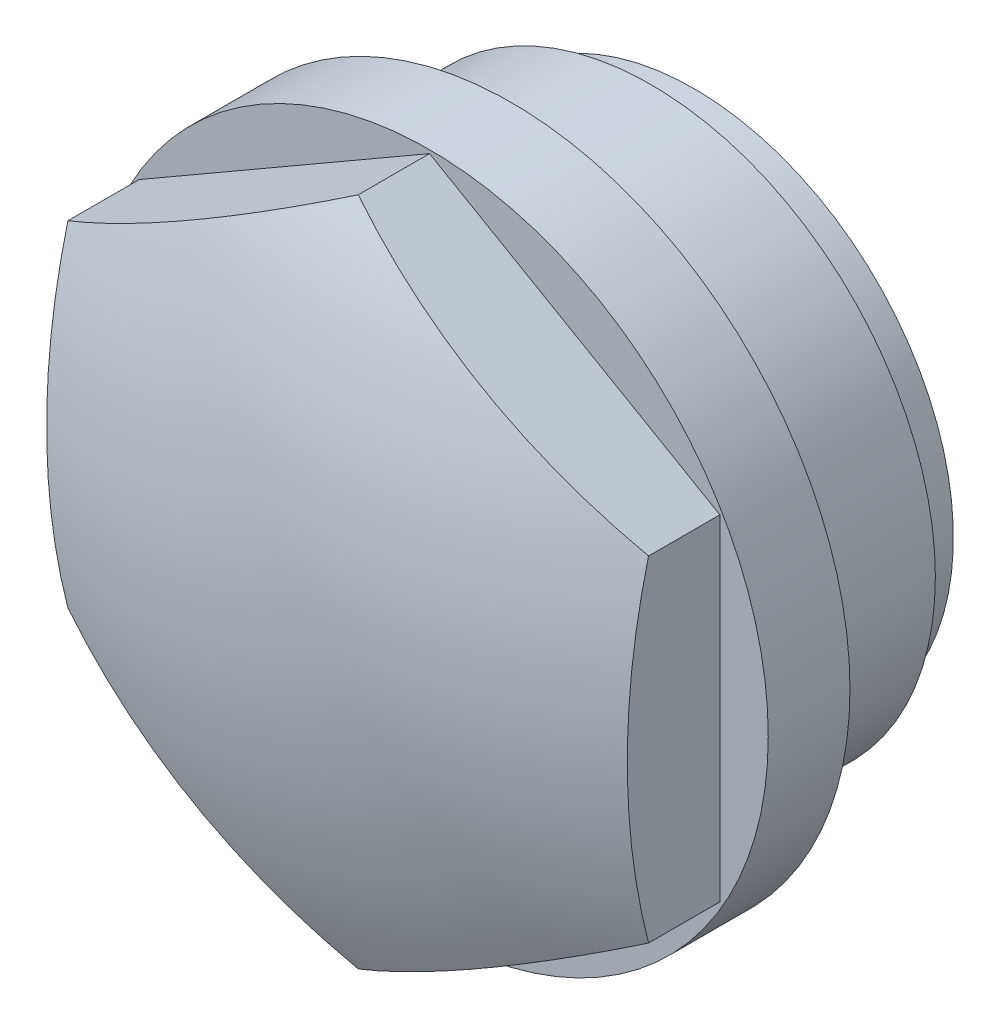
ISO-10303-21;
HEADER;
FILE_DESCRIPTION(('STEP AP214'),'2;1');
FILE_NAME('part.step','',(''),(''),'','','');
FILE_SCHEMA(('AUTOMOTIVE_DESIGN { 1 0 10303 214 1 1 1 1 }'));
ENDSEC;
DATA;
#1=APPLICATION_CONTEXT('core data for automotive mechanical design processes');
#2=APPLICATION_PROTOCOL_DEFINITION('international standard','automotive_design',2000,#1);
#3=PRODUCT_CONTEXT('',#1,'mechanical');
#4=PRODUCT('Part','Part','',(#3));
#5=PRODUCT_RELATED_PRODUCT_CATEGORY('part','',(#4));
#6=PRODUCT_DEFINITION_FORMATION('','',#4);
#7=PRODUCT_DEFINITION_CONTEXT('part definition',#1,'design');
#8=PRODUCT_DEFINITION('design','',#6,#7);
#9=PRODUCT_DEFINITION_SHAPE('','',#8);
#10=(LENGTH_UNIT() NAMED_UNIT(*) SI_UNIT(.MILLI.,.METRE.));
#11=(NAMED_UNIT(*) PLANE_ANGLE_UNIT() SI_UNIT($,.RADIAN.));
#12=(NAMED_UNIT(*) SI_UNIT($,.STERADIAN.) SOLID_ANGLE_UNIT());
#13=UNCERTAINTY_MEASURE_WITH_UNIT(LENGTH_MEASURE(1.E-05),#10,'distance_accuracy_value','');
#14=(GEOMETRIC_REPRESENTATION_CONTEXT(3) GLOBAL_UNCERTAINTY_ASSIGNED_CONTEXT((#13)) GLOBAL_UNIT_ASSIGNED_CONTEXT((#10,
#11,#12)) REPRESENTATION_CONTEXT('',''));
#15=CARTESIAN_POINT('',(0.,0.,0.));
#16=DIRECTION('',(0.,0.,1.));
#17=DIRECTION('',(1.,0.,0.));
#18=AXIS2_PLACEMENT_3D('',#15,#16,#17);
#19=CARTESIAN_POINT('',(0.,0.,-15.016713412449));
#20=DIRECTION('',(0.,0.,-1.));
#21=DIRECTION('',(-1.,0.,0.));
#22=AXIS2_PLACEMENT_3D('',#19,#20,#21);
#23=CYLINDRICAL_SURFACE('',#22,15.7499999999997);
#24=CARTESIAN_POINT('',(0.,0.,0.));
#25=DIRECTION('',(0.,0.,-1.));
#26=DIRECTION('',(-1.,0.,0.));
#27=AXIS2_PLACEMENT_3D('',#24,#25,#26);
#28=CIRCLE('',#27,15.75);
#29=CARTESIAN_POINT('',(-15.75,0.,0.));
#30=VERTEX_POINT('',#29);
#31=EDGE_CURVE('E103',#30,#30,#28,.T.);
#32=ORIENTED_EDGE('',*,*,#31,.F.);
#33=EDGE_LOOP('',(#32));
#34=FACE_BOUND('',#33,.T.);
#35=CARTESIAN_POINT('',(0.,0.,3.8));
#36=DIRECTION('',(0.,0.,-1.));
#37=DIRECTION('',(-1.,0.,0.));
#38=AXIS2_PLACEMENT_3D('',#35,#36,#37);
#39=CIRCLE('',#38,15.7499999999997);
#40=CARTESIAN_POINT('',(-15.7499999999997,0.,3.8));
#41=VERTEX_POINT('',#40);
#42=EDGE_CURVE('E118',#41,#41,#39,.T.);
#43=ORIENTED_EDGE('',*,*,#42,.T.);
#44=EDGE_LOOP('',(#43));
#45=FACE_BOUND('',#44,.T.);
#46=ADVANCED_FACE('F14',(#34,#45),#23,.T.);
#47=CARTESIAN_POINT('',(0.,15.58845726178,3.8));
#48=DIRECTION('',(0.,0.,-1.));
#49=DIRECTION('',(-1.,0.,0.));
#50=AXIS2_PLACEMENT_3D('',#47,#48,#49);
#51=PLANE('',#50);
#52=ORIENTED_EDGE('',*,*,#42,.F.);
#53=EDGE_LOOP('',(#52));
#54=FACE_BOUND('',#53,.T.);
#55=DIRECTION('',(0.,1.,0.));
#56=VECTOR('',#55,1.);
#57=CARTESIAN_POINT('',(-13.4999999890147,-7.79422862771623,3.8));
#58=LINE('',#57,#56);
#59=CARTESIAN_POINT('',(-13.4999999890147,-7.79422862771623,3.8));
#60=VERTEX_POINT('',#59);
#61=CARTESIAN_POINT('',(-13.4999999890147,7.79422862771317,3.8));
#62=VERTEX_POINT('',#61);
#63=EDGE_CURVE('E93',#60,#62,#58,.T.);
#64=ORIENTED_EDGE('',*,*,#63,.T.);
#65=DIRECTION('',(0.866025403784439,0.5,0.));
#66=VECTOR('',#65,1.);
#67=CARTESIAN_POINT('',(-13.4999999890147,7.79422862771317,3.8));
#68=LINE('',#67,#66);
#69=CARTESIAN_POINT('',(-6.93889390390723E-12,15.588457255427,3.8));
#70=VERTEX_POINT('',#69);
#71=EDGE_CURVE('E83',#62,#70,#68,.T.);
#72=ORIENTED_EDGE('',*,*,#71,.T.);
#73=DIRECTION('',(0.866025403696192,-0.500000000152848,0.));
#74=VECTOR('',#73,1.);
#75=CARTESIAN_POINT('',(-6.93889390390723E-12,15.588457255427,3.8));
#76=LINE('',#75,#74);
#77=CARTESIAN_POINT('',(13.4999999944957,7.79422862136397,3.8));
#78=VERTEX_POINT('',#77);
#79=EDGE_CURVE('E68',#70,#78,#76,.T.);
#80=ORIENTED_EDGE('',*,*,#79,.T.);
#81=DIRECTION('',(0.,-1.,0.));
#82=VECTOR('',#81,1.);
#83=CARTESIAN_POINT('',(13.4999999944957,7.79422862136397,3.8));
#84=LINE('',#83,#82);
#85=CARTESIAN_POINT('',(13.4999999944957,-7.79422863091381,3.8));
#86=VERTEX_POINT('',#85);
#87=EDGE_CURVE('E80',#78,#86,#84,.T.);
#88=ORIENTED_EDGE('',*,*,#87,.T.);
#89=DIRECTION('',(-0.866025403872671,-0.499999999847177,0.));
#90=VECTOR('',#89,1.);
#91=CARTESIAN_POINT('',(13.4999999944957,-7.79422862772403,3.8));
#92=LINE('',#91,#90);
#93=CARTESIAN_POINT('',(-3.60822483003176E-12,-15.5884572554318,3.8));
#94=VERTEX_POINT('',#93);
#95=EDGE_CURVE('E28',#86,#94,#92,.T.);
#96=ORIENTED_EDGE('',*,*,#95,.T.);
#97=DIRECTION('',(-0.866025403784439,0.5,0.));
#98=VECTOR('',#97,1.);
#99=CARTESIAN_POINT('',(-3.60822483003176E-12,-15.5884572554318,3.8));
#100=LINE('',#99,#98);
#101=EDGE_CURVE('E87',#94,#60,#100,.T.);
#102=ORIENTED_EDGE('',*,*,#101,.T.);
#103=EDGE_LOOP('',(#64,#72,#80,#88,#96,#102));
#104=FACE_BOUND('',#103,.T.);
#105=ADVANCED_FACE('F79',(#54,#104),#51,.F.);
#106=CARTESIAN_POINT('',(0.,0.,-8.5));
#107=DIRECTION('',(0.,0.,-1.));
#108=DIRECTION('',(-1.,0.,0.));
#109=AXIS2_PLACEMENT_3D('',#106,#107,#108);
#110=PLANE('',#109);
#111=CARTESIAN_POINT('',(0.,0.,-8.5));
#112=DIRECTION('',(0.,0.,-1.));
#113=DIRECTION('',(-1.,0.,0.));
#114=AXIS2_PLACEMENT_3D('',#111,#112,#113);
#115=CIRCLE('',#114,12.0585);
#116=CARTESIAN_POINT('',(-12.0585,0.,-8.5));
#117=VERTEX_POINT('',#116);
#118=EDGE_CURVE('E115',#117,#117,#115,.T.);
#119=ORIENTED_EDGE('',*,*,#118,.T.);
#120=EDGE_LOOP('',(#119));
#121=FACE_BOUND('',#120,.T.);
#122=ADVANCED_FACE('F160',(#121),#110,.T.);
#123=CARTESIAN_POINT('',(0.,0.,-15.016713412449));
#124=DIRECTION('',(0.,0.,-1.));
#125=DIRECTION('',(-1.,0.,0.));
#126=AXIS2_PLACEMENT_3D('',#123,#124,#125);
#127=CYLINDRICAL_SURFACE('',#126,12.0585);
#128=ORIENTED_EDGE('',*,*,#118,.F.);
#129=EDGE_LOOP('',(#128));
#130=FACE_BOUND('',#129,.T.);
#131=CARTESIAN_POINT('',(0.,0.,-6.5));
#132=DIRECTION('',(0.,0.,-1.));
#133=DIRECTION('',(-1.,0.,0.));
#134=AXIS2_PLACEMENT_3D('',#131,#132,#133);
#135=CIRCLE('',#134,12.0585);
#136=CARTESIAN_POINT('',(-12.0585,0.,-6.5));
#137=VERTEX_POINT('',#136);
#138=EDGE_CURVE('E112',#137,#137,#135,.T.);
#139=ORIENTED_EDGE('',*,*,#138,.T.);
#140=EDGE_LOOP('',(#139));
#141=FACE_BOUND('',#140,.T.);
#142=ADVANCED_FACE('F184',(#130,#141),#127,.T.);
#143=CARTESIAN_POINT('',(0.,12.0585,-6.5));
#144=DIRECTION('',(0.,0.,-1.));
#145=DIRECTION('',(-1.,0.,0.));
#146=AXIS2_PLACEMENT_3D('',#143,#144,#145);
#147=PLANE('',#146);
#148=CARTESIAN_POINT('',(0.,0.,-6.5));
#149=DIRECTION('',(0.,0.,-1.));
#150=DIRECTION('',(-1.,0.,0.));
#151=AXIS2_PLACEMENT_3D('',#148,#149,#150);
#152=CIRCLE('',#151,13.2205);
#153=CARTESIAN_POINT('',(-13.2205,0.,-6.5));
#154=VERTEX_POINT('',#153);
#155=EDGE_CURVE('E109',#154,#154,#152,.T.);
#156=ORIENTED_EDGE('',*,*,#155,.T.);
#157=EDGE_LOOP('',(#156));
#158=FACE_BOUND('',#157,.T.);
#159=ORIENTED_EDGE('',*,*,#138,.F.);
#160=EDGE_LOOP('',(#159));
#161=FACE_BOUND('',#160,.T.);
#162=ADVANCED_FACE('F177',(#158,#161),#147,.T.);
#163=CARTESIAN_POINT('',(0.,0.,-15.016713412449));
#164=DIRECTION('',(0.,0.,-1.));
#165=DIRECTION('',(-1.,0.,0.));
#166=AXIS2_PLACEMENT_3D('',#163,#164,#165);
#167=CYLINDRICAL_SURFACE('',#166,13.2205);
#168=ORIENTED_EDGE('',*,*,#155,.F.);
#169=EDGE_LOOP('',(#168));
#170=FACE_BOUND('',#169,.T.);
#171=CARTESIAN_POINT('',(0.,0.,0.));
#172=DIRECTION('',(0.,0.,-1.));
#173=DIRECTION('',(-1.,0.,0.));
#174=AXIS2_PLACEMENT_3D('',#171,#172,#173);
#175=CIRCLE('',#174,13.2205);
#176=CARTESIAN_POINT('',(-13.2205,0.,0.));
#177=VERTEX_POINT('',#176);
#178=EDGE_CURVE('E106',#177,#177,#175,.T.);
#179=ORIENTED_EDGE('',*,*,#178,.T.);
#180=EDGE_LOOP('',(#179));
#181=FACE_BOUND('',#180,.T.);
#182=ADVANCED_FACE('F168',(#170,#181),#167,.T.);
#183=CARTESIAN_POINT('',(0.,15.75,0.));
#184=DIRECTION('',(0.,0.,1.));
#185=DIRECTION('',(1.,0.,0.));
#186=AXIS2_PLACEMENT_3D('',#183,#184,#185);
#187=PLANE('',#186);
#188=ORIENTED_EDGE('',*,*,#178,.F.);
#189=EDGE_LOOP('',(#188));
#190=FACE_BOUND('',#189,.T.);
#191=ORIENTED_EDGE('',*,*,#31,.T.);
#192=EDGE_LOOP('',(#191));
#193=FACE_BOUND('',#192,.T.);
#194=ADVANCED_FACE('F166',(#190,#193),#187,.F.);
#195=CARTESIAN_POINT('',(-13.4999999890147,7.79422862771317,10.9000000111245));
#196=DIRECTION('',(-0.5,0.866025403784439,0.));
#197=DIRECTION('',(0.866025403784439,0.5,0.));
#198=AXIS2_PLACEMENT_3D('',#195,#196,#197);
#199=PLANE('',#198);
#200=DIRECTION('',(0.,0.,-1.));
#201=VECTOR('',#200,1.);
#202=CARTESIAN_POINT('',(-6.93889390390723E-12,15.588457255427,10.9000000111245));
#203=LINE('',#202,#201);
#204=CARTESIAN_POINT('',(-1.10110487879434E-08,15.58845726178,7.1158898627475));
#205=VERTEX_POINT('',#204);
#206=EDGE_CURVE('E36',#205,#70,#203,.T.);
#207=ORIENTED_EDGE('',*,*,#206,.T.);
#208=ORIENTED_EDGE('',*,*,#71,.F.);
#209=DIRECTION('',(0.,0.,-1.));
#210=VECTOR('',#209,1.);
#211=CARTESIAN_POINT('',(-13.4999999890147,7.79422862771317,10.9000000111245));
#212=LINE('',#211,#210);
#213=CARTESIAN_POINT('',(-13.4999999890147,7.79422862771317,7.11588986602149));
#214=VERTEX_POINT('',#213);
#215=EDGE_CURVE('E101',#214,#62,#212,.T.);
#216=ORIENTED_EDGE('',*,*,#215,.F.);
#217=CARTESIAN_POINT('',(-6.74999999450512,11.6913429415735,-23.0999999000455));
#218=DIRECTION('',(-0.5,0.866025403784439,0.));
#219=DIRECTION('',(0.866025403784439,0.5,0.));
#220=AXIS2_PLACEMENT_3D('',#217,#218,#219);
#221=CIRCLE('',#220,31.2049674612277);
#222=EDGE_CURVE('E9',#205,#214,#221,.F.);
#223=ORIENTED_EDGE('',*,*,#222,.F.);
#224=EDGE_LOOP('',(#207,#208,#216,#223));
#225=FACE_BOUND('',#224,.T.);
#226=ADVANCED_FACE('F138',(#225),#199,.T.);
#227=CARTESIAN_POINT('',(-13.4999999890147,-7.79422862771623,10.9000000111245));
#228=DIRECTION('',(-1.,0.,0.));
#229=DIRECTION('',(0.,0.,1.));
#230=AXIS2_PLACEMENT_3D('',#227,#228,#229);
#231=PLANE('',#230);
#232=ORIENTED_EDGE('',*,*,#215,.T.);
#233=ORIENTED_EDGE('',*,*,#63,.F.);
#234=DIRECTION('',(0.,0.,-1.));
#235=VECTOR('',#234,1.);
#236=CARTESIAN_POINT('',(-13.4999999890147,-7.79422862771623,10.9000000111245));
#237=LINE('',#236,#235);
#238=CARTESIAN_POINT('',(-13.4999999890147,-7.79422862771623,7.11588986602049));
#239=VERTEX_POINT('',#238);
#240=EDGE_CURVE('E99',#239,#60,#237,.T.);
#241=ORIENTED_EDGE('',*,*,#240,.F.);
#242=CARTESIAN_POINT('',(-13.4999999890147,0.,-23.0999999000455));
#243=DIRECTION('',(-1.,0.,0.));
#244=DIRECTION('',(0.,0.,1.));
#245=AXIS2_PLACEMENT_3D('',#242,#243,#244);
#246=CIRCLE('',#245,31.2049674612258);
#247=EDGE_CURVE('E21',#214,#239,#246,.F.);
#248=ORIENTED_EDGE('',*,*,#247,.F.);
#249=EDGE_LOOP('',(#232,#233,#241,#248));
#250=FACE_BOUND('',#249,.T.);
#251=ADVANCED_FACE('F135',(#250),#231,.T.);
#252=CARTESIAN_POINT('',(-3.60822483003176E-12,-15.5884572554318,10.9000000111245));
#253=DIRECTION('',(-0.5,-0.866025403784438,0.));
#254=DIRECTION('',(-0.866025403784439,0.5,0.));
#255=AXIS2_PLACEMENT_3D('',#252,#253,#254);
#256=PLANE('',#255);
#257=ORIENTED_EDGE('',*,*,#240,.T.);
#258=ORIENTED_EDGE('',*,*,#101,.F.);
#259=DIRECTION('',(0.,0.,-1.));
#260=VECTOR('',#259,1.);
#261=CARTESIAN_POINT('',(-3.60822483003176E-12,-15.5884572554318,10.9000000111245));
#262=LINE('',#261,#260);
#263=CARTESIAN_POINT('',(-3.60215329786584E-12,-15.5884572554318,7.11588986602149));
#264=VERTEX_POINT('',#263);
#265=EDGE_CURVE('E97',#264,#94,#262,.T.);
#266=ORIENTED_EDGE('',*,*,#265,.F.);
#267=CARTESIAN_POINT('',(-6.74999999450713,-11.691342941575,-23.0999999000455));
#268=DIRECTION('',(-0.5,-0.866025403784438,0.));
#269=DIRECTION('',(-0.866025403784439,0.5,0.));
#270=AXIS2_PLACEMENT_3D('',#267,#268,#269);
#271=CIRCLE('',#270,31.204967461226);
#272=EDGE_CURVE('E127',#239,#264,#271,.F.);
#273=ORIENTED_EDGE('',*,*,#272,.F.);
#274=EDGE_LOOP('',(#257,#258,#266,#273));
#275=FACE_BOUND('',#274,.T.);
#276=ADVANCED_FACE('F143',(#275),#256,.T.);
#277=CARTESIAN_POINT('',(13.4999999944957,-7.79422862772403,10.9000000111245));
#278=DIRECTION('',(0.499999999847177,-0.866025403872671,0.));
#279=DIRECTION('',(-0.866025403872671,-0.499999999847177,0.));
#280=AXIS2_PLACEMENT_3D('',#277,#278,#279);
#281=PLANE('',#280);
#282=ORIENTED_EDGE('',*,*,#265,.T.);
#283=ORIENTED_EDGE('',*,*,#95,.F.);
#284=DIRECTION('',(0.,0.,-1.));
#285=VECTOR('',#284,1.);
#286=CARTESIAN_POINT('',(13.4999999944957,-7.79422862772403,10.9000000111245));
#287=LINE('',#286,#285);
#288=CARTESIAN_POINT('',(13.4999999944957,-7.79422862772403,7.11588986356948));
#289=VERTEX_POINT('',#288);
#290=EDGE_CURVE('E74',#289,#86,#287,.T.);
#291=ORIENTED_EDGE('',*,*,#290,.F.);
#292=CARTESIAN_POINT('',(6.74999999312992,-11.6913429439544,-23.0999999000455));
#293=DIRECTION('',(0.499999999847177,-0.866025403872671,0.));
#294=DIRECTION('',(-0.866025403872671,-0.499999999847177,0.));
#295=AXIS2_PLACEMENT_3D('',#292,#293,#294);
#296=CIRCLE('',#295,31.2049674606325);
#297=EDGE_CURVE('E124',#264,#289,#296,.F.);
#298=ORIENTED_EDGE('',*,*,#297,.F.);
#299=EDGE_LOOP('',(#282,#283,#291,#298));
#300=FACE_BOUND('',#299,.T.);
#301=ADVANCED_FACE('F139',(#300),#281,.T.);
#302=CARTESIAN_POINT('',(13.4999999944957,7.79422862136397,10.9000000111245));
#303=DIRECTION('',(1.,0.,0.));
#304=DIRECTION('',(0.,0.,-1.));
#305=AXIS2_PLACEMENT_3D('',#302,#303,#304);
#306=PLANE('',#305);
#307=ORIENTED_EDGE('',*,*,#290,.T.);
#308=ORIENTED_EDGE('',*,*,#87,.F.);
#309=DIRECTION('',(0.,0.,-1.));
#310=VECTOR('',#309,1.);
#311=CARTESIAN_POINT('',(13.4999999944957,7.79422862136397,10.9000000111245));
#312=LINE('',#311,#310);
#313=CARTESIAN_POINT('',(13.4999999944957,7.79422862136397,7.1158898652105));
#314=VERTEX_POINT('',#313);
#315=EDGE_CURVE('E65',#314,#78,#312,.T.);
#316=ORIENTED_EDGE('',*,*,#315,.F.);
#317=CARTESIAN_POINT('',(13.4999999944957,0.,-23.0999999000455));
#318=DIRECTION('',(1.,0.,0.));
#319=DIRECTION('',(0.,0.,-1.));
#320=AXIS2_PLACEMENT_3D('',#317,#318,#319);
#321=CIRCLE('',#320,31.2049674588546);
#322=EDGE_CURVE('E122',#289,#314,#321,.F.);
#323=ORIENTED_EDGE('',*,*,#322,.F.);
#324=EDGE_LOOP('',(#307,#308,#316,#323));
#325=FACE_BOUND('',#324,.T.);
#326=ADVANCED_FACE('F85',(#325),#306,.T.);
#327=CARTESIAN_POINT('',(-6.93889390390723E-12,15.588457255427,10.9000000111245));
#328=DIRECTION('',(0.500000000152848,0.866025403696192,0.));
#329=DIRECTION('',(0.866025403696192,-0.500000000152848,0.));
#330=AXIS2_PLACEMENT_3D('',#327,#328,#329);
#331=PLANE('',#330);
#332=ORIENTED_EDGE('',*,*,#315,.T.);
#333=ORIENTED_EDGE('',*,*,#79,.F.);
#334=ORIENTED_EDGE('',*,*,#206,.F.);
#335=CARTESIAN_POINT('',(6.74999999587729,11.6913429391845,-23.0999999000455));
#336=DIRECTION('',(0.500000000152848,0.866025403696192,0.));
#337=DIRECTION('',(0.866025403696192,-0.500000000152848,0.));
#338=AXIS2_PLACEMENT_3D('',#335,#336,#337);
#339=CIRCLE('',#338,31.2049674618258);
#340=EDGE_CURVE('E70',#314,#205,#339,.F.);
#341=ORIENTED_EDGE('',*,*,#340,.F.);
#342=EDGE_LOOP('',(#332,#333,#334,#341));
#343=FACE_BOUND('',#342,.T.);
#344=ADVANCED_FACE('F67',(#343),#331,.T.);
#345=CARTESIAN_POINT('',(0.,0.,-23.0999999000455));
#346=DIRECTION('',(1.,0.,0.));
#347=DIRECTION('',(0.,0.,-1.));
#348=AXIS2_PLACEMENT_3D('',#345,#346,#347);
#349=SPHERICAL_SURFACE('',#348,33.99999991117);
#350=ORIENTED_EDGE('',*,*,#340,.T.);
#351=ORIENTED_EDGE('',*,*,#222,.T.);
#352=ORIENTED_EDGE('',*,*,#247,.T.);
#353=ORIENTED_EDGE('',*,*,#272,.T.);
#354=ORIENTED_EDGE('',*,*,#297,.T.);
#355=ORIENTED_EDGE('',*,*,#322,.T.);
#356=EDGE_LOOP('',(#350,#351,#352,#353,#354,#355));
#357=FACE_BOUND('',#356,.T.);
#358=ADVANCED_FACE('F131',(#357),#349,.T.);
#359=CLOSED_SHELL('',(#46,#105,#122,#142,#162,#182,#194,#226,#251,#276,#301,#326,#344,#358));
#360=MANIFOLD_SOLID_BREP('B1',#359);
#361=ADVANCED_BREP_SHAPE_REPRESENTATION('',(#18,#360),#14);
#362=SHAPE_DEFINITION_REPRESENTATION(#9,#361);
ENDSEC;
END-ISO-10303-21;
